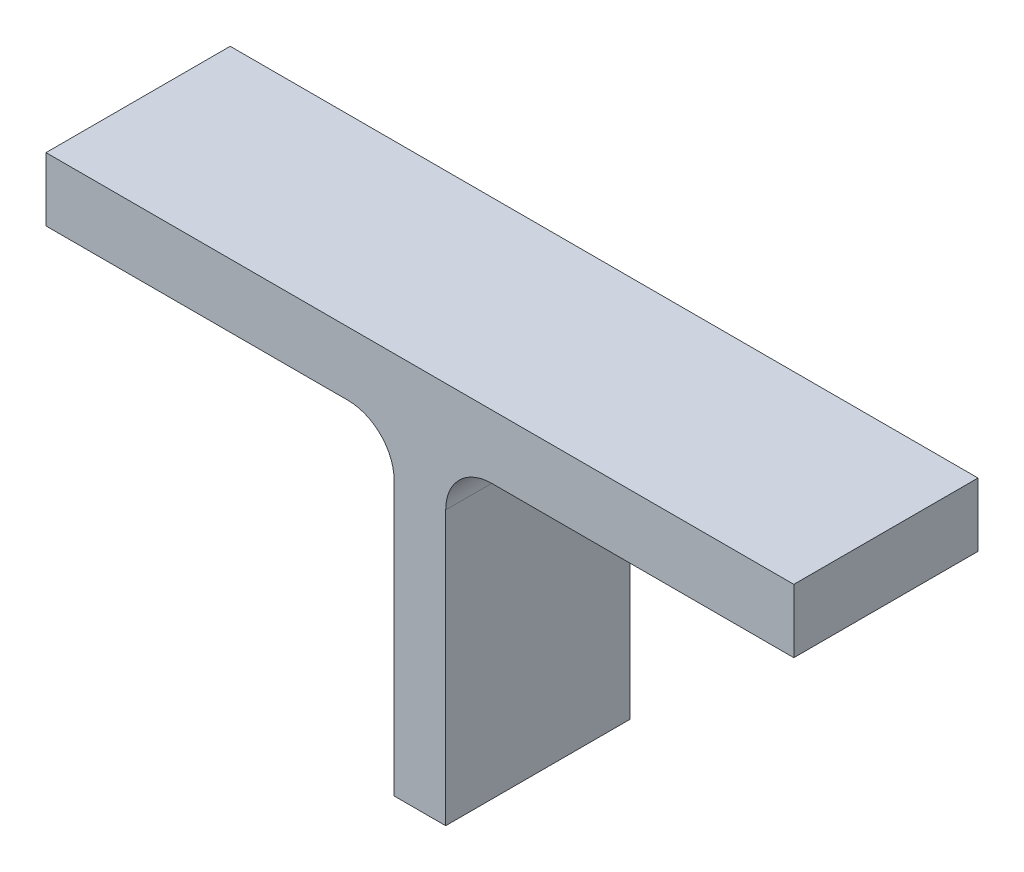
ISO-10303-21;
HEADER;
FILE_DESCRIPTION(('STEP AP214'),'2;1');
FILE_NAME('part.step','',(''),(''),'','','');
FILE_SCHEMA(('AUTOMOTIVE_DESIGN { 1 0 10303 214 1 1 1 1 }'));
ENDSEC;
DATA;
#1=APPLICATION_CONTEXT('core data for automotive mechanical design processes');
#2=APPLICATION_PROTOCOL_DEFINITION('international standard','automotive_design',2000,#1);
#3=PRODUCT_CONTEXT('',#1,'mechanical');
#4=PRODUCT('Part','Part','',(#3));
#5=PRODUCT_RELATED_PRODUCT_CATEGORY('part','',(#4));
#6=PRODUCT_DEFINITION_FORMATION('','',#4);
#7=PRODUCT_DEFINITION_CONTEXT('part definition',#1,'design');
#8=PRODUCT_DEFINITION('design','',#6,#7);
#9=PRODUCT_DEFINITION_SHAPE('','',#8);
#10=(LENGTH_UNIT() NAMED_UNIT(*) SI_UNIT(.MILLI.,.METRE.));
#11=(NAMED_UNIT(*) PLANE_ANGLE_UNIT() SI_UNIT($,.RADIAN.));
#12=(NAMED_UNIT(*) SI_UNIT($,.STERADIAN.) SOLID_ANGLE_UNIT());
#13=UNCERTAINTY_MEASURE_WITH_UNIT(LENGTH_MEASURE(1.E-05),#10,'distance_accuracy_value','');
#14=(GEOMETRIC_REPRESENTATION_CONTEXT(3) GLOBAL_UNCERTAINTY_ASSIGNED_CONTEXT((#13)) GLOBAL_UNIT_ASSIGNED_CONTEXT((#10,
#11,#12)) REPRESENTATION_CONTEXT('',''));
#15=CARTESIAN_POINT('',(0.,0.,0.));
#16=DIRECTION('',(0.,0.,1.));
#17=DIRECTION('',(1.,0.,0.));
#18=AXIS2_PLACEMENT_3D('',#15,#16,#17);
#19=CARTESIAN_POINT('',(-3.55599691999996,0.,-12.7));
#20=DIRECTION('',(-1.,0.,0.));
#21=DIRECTION('',(0.,-1.,0.));
#22=AXIS2_PLACEMENT_3D('',#19,#20,#21);
#23=PLANE('',#22);
#24=DIRECTION('',(0.,-1.,0.));
#25=VECTOR('',#24,1.);
#26=CARTESIAN_POINT('',(-3.55599691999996,0.,12.7));
#27=LINE('',#26,#25);
#28=CARTESIAN_POINT('',(-3.55599691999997,37.71901309,12.7));
#29=VERTEX_POINT('',#28);
#30=CARTESIAN_POINT('',(-3.55599691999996,0.,12.7));
#31=VERTEX_POINT('',#30);
#32=EDGE_CURVE('E142',#29,#31,#27,.T.);
#33=ORIENTED_EDGE('',*,*,#32,.F.);
#34=DIRECTION('',(0.,0.,1.));
#35=VECTOR('',#34,1.);
#36=CARTESIAN_POINT('',(-3.55599691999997,37.71901309,-12.7));
#37=LINE('',#36,#35);
#38=CARTESIAN_POINT('',(-3.55599691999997,37.71901309,-12.7));
#39=VERTEX_POINT('',#38);
#40=EDGE_CURVE('E11',#39,#29,#37,.T.);
#41=ORIENTED_EDGE('',*,*,#40,.F.);
#42=DIRECTION('',(0.,-1.,0.));
#43=VECTOR('',#42,1.);
#44=CARTESIAN_POINT('',(-3.55599691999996,0.,-12.7));
#45=LINE('',#44,#43);
#46=CARTESIAN_POINT('',(-3.55599691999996,0.,-12.7));
#47=VERTEX_POINT('',#46);
#48=EDGE_CURVE('E168',#39,#47,#45,.T.);
#49=ORIENTED_EDGE('',*,*,#48,.T.);
#50=DIRECTION('',(0.,0.,1.));
#51=VECTOR('',#50,1.);
#52=CARTESIAN_POINT('',(-3.55599691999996,0.,-12.7));
#53=LINE('',#52,#51);
#54=EDGE_CURVE('E36',#47,#31,#53,.T.);
#55=ORIENTED_EDGE('',*,*,#54,.T.);
#56=EDGE_LOOP('',(#33,#41,#49,#55));
#57=FACE_BOUND('',#56,.T.);
#58=ADVANCED_FACE('F33',(#57),#23,.T.);
#59=CARTESIAN_POINT('',(-9.90599141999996,37.71901309,-12.7));
#60=DIRECTION('',(0.,0.,1.));
#61=DIRECTION('',(1.,0.,0.));
#62=AXIS2_PLACEMENT_3D('',#59,#60,#61);
#63=CYLINDRICAL_SURFACE('',#62,6.34999449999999);
#64=CARTESIAN_POINT('',(-9.90599141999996,37.71901309,12.7));
#65=DIRECTION('',(0.,0.,-1.));
#66=DIRECTION('',(1.,0.,0.));
#67=AXIS2_PLACEMENT_3D('',#64,#65,#66);
#68=CIRCLE('',#67,6.34999449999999);
#69=CARTESIAN_POINT('',(-9.90599141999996,44.06900759,12.7));
#70=VERTEX_POINT('',#69);
#71=EDGE_CURVE('E166',#70,#29,#68,.T.);
#72=ORIENTED_EDGE('',*,*,#71,.F.);
#73=DIRECTION('',(0.,0.,1.));
#74=VECTOR('',#73,1.);
#75=CARTESIAN_POINT('',(-9.90599141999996,44.06900759,-12.7));
#76=LINE('',#75,#74);
#77=CARTESIAN_POINT('',(-9.90599141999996,44.06900759,-12.7));
#78=VERTEX_POINT('',#77);
#79=EDGE_CURVE('E42',#78,#70,#76,.T.);
#80=ORIENTED_EDGE('',*,*,#79,.F.);
#81=CARTESIAN_POINT('',(-9.90599141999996,37.71901309,-12.7));
#82=DIRECTION('',(0.,0.,-1.));
#83=DIRECTION('',(1.,0.,0.));
#84=AXIS2_PLACEMENT_3D('',#81,#82,#83);
#85=CIRCLE('',#84,6.34999449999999);
#86=EDGE_CURVE('E132',#78,#39,#85,.T.);
#87=ORIENTED_EDGE('',*,*,#86,.T.);
#88=ORIENTED_EDGE('',*,*,#40,.T.);
#89=EDGE_LOOP('',(#72,#80,#87,#88));
#90=FACE_BOUND('',#89,.T.);
#91=ADVANCED_FACE('F184',(#90),#63,.F.);
#92=CARTESIAN_POINT('',(-9.90599141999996,44.06900759,-12.7));
#93=DIRECTION('',(0.,-1.,0.));
#94=DIRECTION('',(1.,0.,0.));
#95=AXIS2_PLACEMENT_3D('',#92,#93,#94);
#96=PLANE('',#95);
#97=DIRECTION('',(1.,0.,0.));
#98=VECTOR('',#97,1.);
#99=CARTESIAN_POINT('',(-9.90599141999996,44.06900759,12.7));
#100=LINE('',#99,#98);
#101=CARTESIAN_POINT('',(-51.56195534,44.06900759,12.7));
#102=VERTEX_POINT('',#101);
#103=EDGE_CURVE('E119',#102,#70,#100,.T.);
#104=ORIENTED_EDGE('',*,*,#103,.F.);
#105=DIRECTION('',(0.,0.,1.));
#106=VECTOR('',#105,1.);
#107=CARTESIAN_POINT('',(-51.56195534,44.06900759,-12.7));
#108=LINE('',#107,#106);
#109=CARTESIAN_POINT('',(-51.56195534,44.06900759,-12.7));
#110=VERTEX_POINT('',#109);
#111=EDGE_CURVE('E114',#110,#102,#108,.T.);
#112=ORIENTED_EDGE('',*,*,#111,.F.);
#113=DIRECTION('',(1.,0.,0.));
#114=VECTOR('',#113,1.);
#115=CARTESIAN_POINT('',(-9.90599141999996,44.06900759,-12.7));
#116=LINE('',#115,#114);
#117=EDGE_CURVE('E117',#110,#78,#116,.T.);
#118=ORIENTED_EDGE('',*,*,#117,.T.);
#119=ORIENTED_EDGE('',*,*,#79,.T.);
#120=EDGE_LOOP('',(#104,#112,#118,#119));
#121=FACE_BOUND('',#120,.T.);
#122=ADVANCED_FACE('F116',(#121),#96,.T.);
#123=CARTESIAN_POINT('',(-51.56195534,44.06900759,-12.7));
#124=DIRECTION('',(-1.,0.,0.));
#125=DIRECTION('',(0.,-1.,0.));
#126=AXIS2_PLACEMENT_3D('',#123,#124,#125);
#127=PLANE('',#126);
#128=DIRECTION('',(0.,-1.,0.));
#129=VECTOR('',#128,1.);
#130=CARTESIAN_POINT('',(-51.56195534,44.06900759,12.7));
#131=LINE('',#130,#129);
#132=CARTESIAN_POINT('',(-51.56195534,52.832,12.7));
#133=VERTEX_POINT('',#132);
#134=EDGE_CURVE('E163',#133,#102,#131,.T.);
#135=ORIENTED_EDGE('',*,*,#134,.F.);
#136=DIRECTION('',(0.,0.,1.));
#137=VECTOR('',#136,1.);
#138=CARTESIAN_POINT('',(-51.56195534,52.832,-12.7));
#139=LINE('',#138,#137);
#140=CARTESIAN_POINT('',(-51.56195534,52.832,-12.7));
#141=VERTEX_POINT('',#140);
#142=EDGE_CURVE('E124',#141,#133,#139,.T.);
#143=ORIENTED_EDGE('',*,*,#142,.F.);
#144=DIRECTION('',(0.,-1.,0.));
#145=VECTOR('',#144,1.);
#146=CARTESIAN_POINT('',(-51.56195534,44.06900759,-12.7));
#147=LINE('',#146,#145);
#148=EDGE_CURVE('E130',#141,#110,#147,.T.);
#149=ORIENTED_EDGE('',*,*,#148,.T.);
#150=ORIENTED_EDGE('',*,*,#111,.T.);
#151=EDGE_LOOP('',(#135,#143,#149,#150));
#152=FACE_BOUND('',#151,.T.);
#153=ADVANCED_FACE('F134',(#152),#127,.T.);
#154=CARTESIAN_POINT('',(-51.56195534,52.832,-12.7));
#155=DIRECTION('',(0.,1.,0.));
#156=DIRECTION('',(0.,0.,1.));
#157=AXIS2_PLACEMENT_3D('',#154,#155,#156);
#158=PLANE('',#157);
#159=DIRECTION('',(-1.,0.,0.));
#160=VECTOR('',#159,1.);
#161=CARTESIAN_POINT('',(-51.56195534,52.832,12.7));
#162=LINE('',#161,#160);
#163=CARTESIAN_POINT('',(51.56195534,52.832,12.7));
#164=VERTEX_POINT('',#163);
#165=EDGE_CURVE('E160',#164,#133,#162,.T.);
#166=ORIENTED_EDGE('',*,*,#165,.F.);
#167=DIRECTION('',(0.,0.,1.));
#168=VECTOR('',#167,1.);
#169=CARTESIAN_POINT('',(51.56195534,52.832,-12.7));
#170=LINE('',#169,#168);
#171=CARTESIAN_POINT('',(51.56195534,52.832,-12.7));
#172=VERTEX_POINT('',#171);
#173=EDGE_CURVE('E172',#172,#164,#170,.T.);
#174=ORIENTED_EDGE('',*,*,#173,.F.);
#175=DIRECTION('',(-1.,0.,0.));
#176=VECTOR('',#175,1.);
#177=CARTESIAN_POINT('',(-51.56195534,52.832,-12.7));
#178=LINE('',#177,#176);
#179=EDGE_CURVE('E135',#172,#141,#178,.T.);
#180=ORIENTED_EDGE('',*,*,#179,.T.);
#181=ORIENTED_EDGE('',*,*,#142,.T.);
#182=EDGE_LOOP('',(#166,#174,#180,#181));
#183=FACE_BOUND('',#182,.T.);
#184=ADVANCED_FACE('F197',(#183),#158,.T.);
#185=CARTESIAN_POINT('',(51.56195534,52.832,-12.7));
#186=DIRECTION('',(1.,0.,0.));
#187=DIRECTION('',(0.,1.,0.));
#188=AXIS2_PLACEMENT_3D('',#185,#186,#187);
#189=PLANE('',#188);
#190=DIRECTION('',(0.,1.,0.));
#191=VECTOR('',#190,1.);
#192=CARTESIAN_POINT('',(51.56195534,52.832,12.7));
#193=LINE('',#192,#191);
#194=CARTESIAN_POINT('',(51.56195534,44.06900759,12.7));
#195=VERTEX_POINT('',#194);
#196=EDGE_CURVE('E157',#195,#164,#193,.T.);
#197=ORIENTED_EDGE('',*,*,#196,.F.);
#198=DIRECTION('',(0.,0.,1.));
#199=VECTOR('',#198,1.);
#200=CARTESIAN_POINT('',(51.56195534,44.06900759,-12.7));
#201=LINE('',#200,#199);
#202=CARTESIAN_POINT('',(51.56195534,44.06900759,-12.7));
#203=VERTEX_POINT('',#202);
#204=EDGE_CURVE('E174',#203,#195,#201,.T.);
#205=ORIENTED_EDGE('',*,*,#204,.F.);
#206=DIRECTION('',(0.,1.,0.));
#207=VECTOR('',#206,1.);
#208=CARTESIAN_POINT('',(51.56195534,52.832,-12.7));
#209=LINE('',#208,#207);
#210=EDGE_CURVE('E137',#203,#172,#209,.T.);
#211=ORIENTED_EDGE('',*,*,#210,.T.);
#212=ORIENTED_EDGE('',*,*,#173,.T.);
#213=EDGE_LOOP('',(#197,#205,#211,#212));
#214=FACE_BOUND('',#213,.T.);
#215=ADVANCED_FACE('F200',(#214),#189,.T.);
#216=CARTESIAN_POINT('',(51.56195534,44.06900759,-12.7));
#217=DIRECTION('',(0.,-1.,0.));
#218=DIRECTION('',(1.,0.,0.));
#219=AXIS2_PLACEMENT_3D('',#216,#217,#218);
#220=PLANE('',#219);
#221=DIRECTION('',(1.,0.,0.));
#222=VECTOR('',#221,1.);
#223=CARTESIAN_POINT('',(51.56195534,44.06900759,12.7));
#224=LINE('',#223,#222);
#225=CARTESIAN_POINT('',(9.90599142,44.06900759,12.7));
#226=VERTEX_POINT('',#225);
#227=EDGE_CURVE('E154',#226,#195,#224,.T.);
#228=ORIENTED_EDGE('',*,*,#227,.F.);
#229=DIRECTION('',(0.,0.,1.));
#230=VECTOR('',#229,1.);
#231=CARTESIAN_POINT('',(9.90599142,44.06900759,-12.7));
#232=LINE('',#231,#230);
#233=CARTESIAN_POINT('',(9.90599142,44.06900759,-12.7));
#234=VERTEX_POINT('',#233);
#235=EDGE_CURVE('E176',#234,#226,#232,.T.);
#236=ORIENTED_EDGE('',*,*,#235,.F.);
#237=DIRECTION('',(1.,0.,0.));
#238=VECTOR('',#237,1.);
#239=CARTESIAN_POINT('',(51.56195534,44.06900759,-12.7));
#240=LINE('',#239,#238);
#241=EDGE_CURVE('E299',#234,#203,#240,.T.);
#242=ORIENTED_EDGE('',*,*,#241,.T.);
#243=ORIENTED_EDGE('',*,*,#204,.T.);
#244=EDGE_LOOP('',(#228,#236,#242,#243));
#245=FACE_BOUND('',#244,.T.);
#246=ADVANCED_FACE('F204',(#245),#220,.T.);
#247=CARTESIAN_POINT('',(9.90599142,37.71901309,-12.7));
#248=DIRECTION('',(0.,0.,1.));
#249=DIRECTION('',(1.,0.,0.));
#250=AXIS2_PLACEMENT_3D('',#247,#248,#249);
#251=CYLINDRICAL_SURFACE('',#250,6.34999449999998);
#252=CARTESIAN_POINT('',(9.90599142,37.71901309,12.7));
#253=DIRECTION('',(0.,0.,-1.));
#254=DIRECTION('',(1.,0.,0.));
#255=AXIS2_PLACEMENT_3D('',#252,#253,#254);
#256=CIRCLE('',#255,6.34999449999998);
#257=CARTESIAN_POINT('',(3.55599692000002,37.71901309,12.7));
#258=VERTEX_POINT('',#257);
#259=EDGE_CURVE('E151',#258,#226,#256,.T.);
#260=ORIENTED_EDGE('',*,*,#259,.F.);
#261=DIRECTION('',(0.,0.,1.));
#262=VECTOR('',#261,1.);
#263=CARTESIAN_POINT('',(3.55599692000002,37.71901309,-12.7));
#264=LINE('',#263,#262);
#265=CARTESIAN_POINT('',(3.55599692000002,37.71901309,-12.7));
#266=VERTEX_POINT('',#265);
#267=EDGE_CURVE('E178',#266,#258,#264,.T.);
#268=ORIENTED_EDGE('',*,*,#267,.F.);
#269=CARTESIAN_POINT('',(9.90599142,37.71901309,-12.7));
#270=DIRECTION('',(0.,0.,-1.));
#271=DIRECTION('',(1.,0.,0.));
#272=AXIS2_PLACEMENT_3D('',#269,#270,#271);
#273=CIRCLE('',#272,6.34999449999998);
#274=EDGE_CURVE('E295',#266,#234,#273,.T.);
#275=ORIENTED_EDGE('',*,*,#274,.T.);
#276=ORIENTED_EDGE('',*,*,#235,.T.);
#277=EDGE_LOOP('',(#260,#268,#275,#276));
#278=FACE_BOUND('',#277,.T.);
#279=ADVANCED_FACE('F208',(#278),#251,.F.);
#280=CARTESIAN_POINT('',(3.55599692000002,37.71901309,-12.7));
#281=DIRECTION('',(1.,0.,0.));
#282=DIRECTION('',(0.,1.,0.));
#283=AXIS2_PLACEMENT_3D('',#280,#281,#282);
#284=PLANE('',#283);
#285=DIRECTION('',(0.,1.,0.));
#286=VECTOR('',#285,1.);
#287=CARTESIAN_POINT('',(3.55599692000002,37.71901309,12.7));
#288=LINE('',#287,#286);
#289=CARTESIAN_POINT('',(3.55599692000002,0.,12.7));
#290=VERTEX_POINT('',#289);
#291=EDGE_CURVE('E148',#290,#258,#288,.T.);
#292=ORIENTED_EDGE('',*,*,#291,.F.);
#293=DIRECTION('',(0.,0.,1.));
#294=VECTOR('',#293,1.);
#295=CARTESIAN_POINT('',(3.55599692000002,0.,-12.7));
#296=LINE('',#295,#294);
#297=CARTESIAN_POINT('',(3.55599692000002,0.,-12.7));
#298=VERTEX_POINT('',#297);
#299=EDGE_CURVE('E179',#298,#290,#296,.T.);
#300=ORIENTED_EDGE('',*,*,#299,.F.);
#301=DIRECTION('',(0.,1.,0.));
#302=VECTOR('',#301,1.);
#303=CARTESIAN_POINT('',(3.55599692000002,37.71901309,-12.7));
#304=LINE('',#303,#302);
#305=EDGE_CURVE('E306',#298,#266,#304,.T.);
#306=ORIENTED_EDGE('',*,*,#305,.T.);
#307=ORIENTED_EDGE('',*,*,#267,.T.);
#308=EDGE_LOOP('',(#292,#300,#306,#307));
#309=FACE_BOUND('',#308,.T.);
#310=ADVANCED_FACE('F212',(#309),#284,.T.);
#311=CARTESIAN_POINT('',(-3.55599691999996,0.,-12.7));
#312=DIRECTION('',(0.,-1.,0.));
#313=DIRECTION('',(1.,0.,0.));
#314=AXIS2_PLACEMENT_3D('',#311,#312,#313);
#315=PLANE('',#314);
#316=DIRECTION('',(1.,0.,0.));
#317=VECTOR('',#316,1.);
#318=CARTESIAN_POINT('',(-3.55599691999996,0.,12.7));
#319=LINE('',#318,#317);
#320=EDGE_CURVE('E145',#31,#290,#319,.T.);
#321=ORIENTED_EDGE('',*,*,#320,.F.);
#322=ORIENTED_EDGE('',*,*,#54,.F.);
#323=DIRECTION('',(1.,0.,0.));
#324=VECTOR('',#323,1.);
#325=CARTESIAN_POINT('',(-3.55599691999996,0.,-12.7));
#326=LINE('',#325,#324);
#327=EDGE_CURVE('E308',#47,#298,#326,.T.);
#328=ORIENTED_EDGE('',*,*,#327,.T.);
#329=ORIENTED_EDGE('',*,*,#299,.T.);
#330=EDGE_LOOP('',(#321,#322,#328,#329));
#331=FACE_BOUND('',#330,.T.);
#332=ADVANCED_FACE('F181',(#331),#315,.T.);
#333=CARTESIAN_POINT('',(-9.90599141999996,37.71901309,-12.7));
#334=DIRECTION('',(0.,0.,1.));
#335=DIRECTION('',(1.,0.,0.));
#336=AXIS2_PLACEMENT_3D('',#333,#334,#335);
#337=PLANE('',#336);
#338=ORIENTED_EDGE('',*,*,#48,.F.);
#339=ORIENTED_EDGE('',*,*,#86,.F.);
#340=ORIENTED_EDGE('',*,*,#117,.F.);
#341=ORIENTED_EDGE('',*,*,#148,.F.);
#342=ORIENTED_EDGE('',*,*,#179,.F.);
#343=ORIENTED_EDGE('',*,*,#210,.F.);
#344=ORIENTED_EDGE('',*,*,#241,.F.);
#345=ORIENTED_EDGE('',*,*,#274,.F.);
#346=ORIENTED_EDGE('',*,*,#305,.F.);
#347=ORIENTED_EDGE('',*,*,#327,.F.);
#348=EDGE_LOOP('',(#338,#339,#340,#341,#342,#343,#344,#345,#346,#347));
#349=FACE_BOUND('',#348,.T.);
#350=ADVANCED_FACE('F128',(#349),#337,.F.);
#351=CARTESIAN_POINT('',(-9.90599141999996,37.71901309,12.7));
#352=DIRECTION('',(0.,0.,1.));
#353=DIRECTION('',(1.,0.,0.));
#354=AXIS2_PLACEMENT_3D('',#351,#352,#353);
#355=PLANE('',#354);
#356=ORIENTED_EDGE('',*,*,#32,.T.);
#357=ORIENTED_EDGE('',*,*,#320,.T.);
#358=ORIENTED_EDGE('',*,*,#291,.T.);
#359=ORIENTED_EDGE('',*,*,#259,.T.);
#360=ORIENTED_EDGE('',*,*,#227,.T.);
#361=ORIENTED_EDGE('',*,*,#196,.T.);
#362=ORIENTED_EDGE('',*,*,#165,.T.);
#363=ORIENTED_EDGE('',*,*,#134,.T.);
#364=ORIENTED_EDGE('',*,*,#103,.T.);
#365=ORIENTED_EDGE('',*,*,#71,.T.);
#366=EDGE_LOOP('',(#356,#357,#358,#359,#360,#361,#362,#363,#364,#365));
#367=FACE_BOUND('',#366,.T.);
#368=ADVANCED_FACE('F183',(#367),#355,.T.);
#369=CLOSED_SHELL('',(#58,#91,#122,#153,#184,#215,#246,#279,#310,#332,#350,#368));
#370=MANIFOLD_SOLID_BREP('B2',#369);
#371=ADVANCED_BREP_SHAPE_REPRESENTATION('',(#18,#370),#14);
#372=SHAPE_DEFINITION_REPRESENTATION(#9,#371);
ENDSEC;
END-ISO-10303-21;
